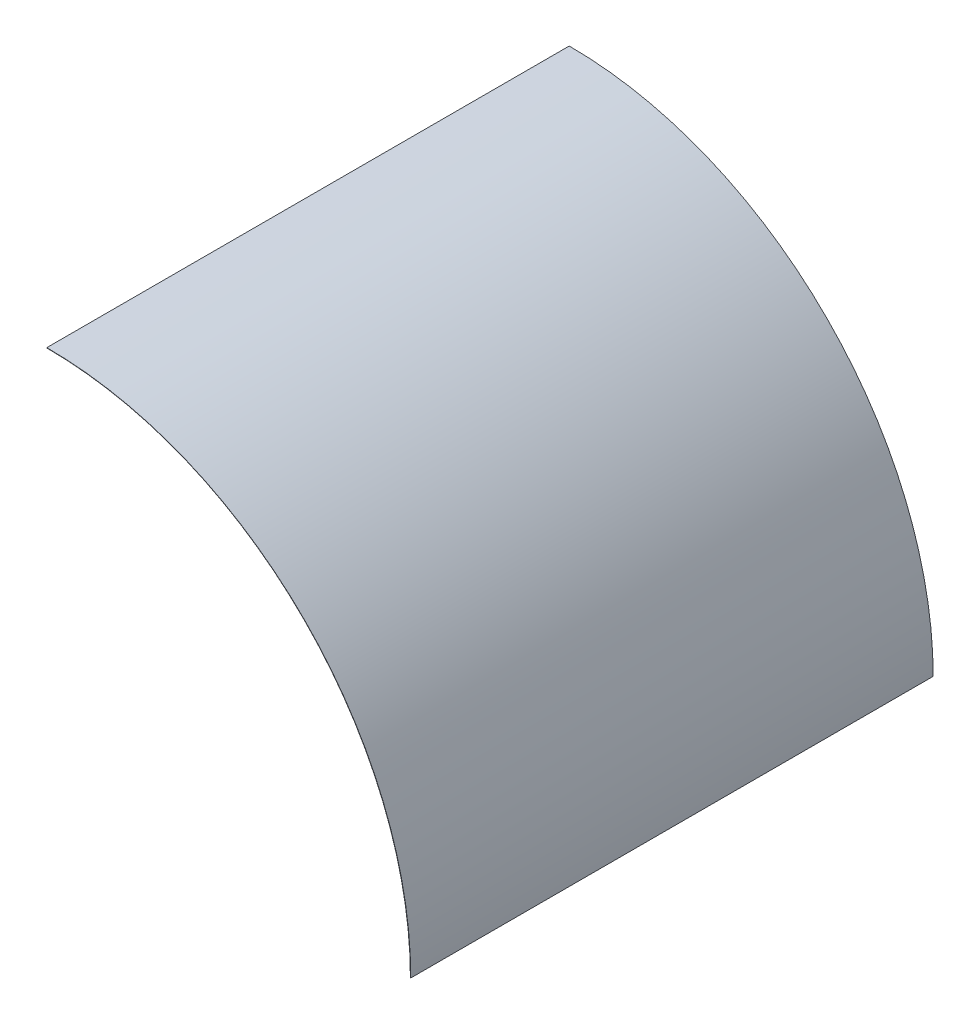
from build123d import *

# Parameters (mm, degrees)
BOSS_EXTRUDE1_DEPTH = 3000


with BuildPart() as part:
    # Sketch1 → Boss-Extrude1 (new body)
    with BuildSketch(Plane.XY):
        with BuildLine():
            Line((0, 2090), (0, 2088))
            ThreePointArc((0, 2088), (1476.438959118, 1476.438959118), (2088, 0))
            Line((2088, 0), (2090, 0))
            ThreePointArc((2090, 0), (1477.85317268, 1477.85317268), (0, 2090))
        make_face()
    extrude(amount=-BOSS_EXTRUDE1_DEPTH)


solid = part.part
